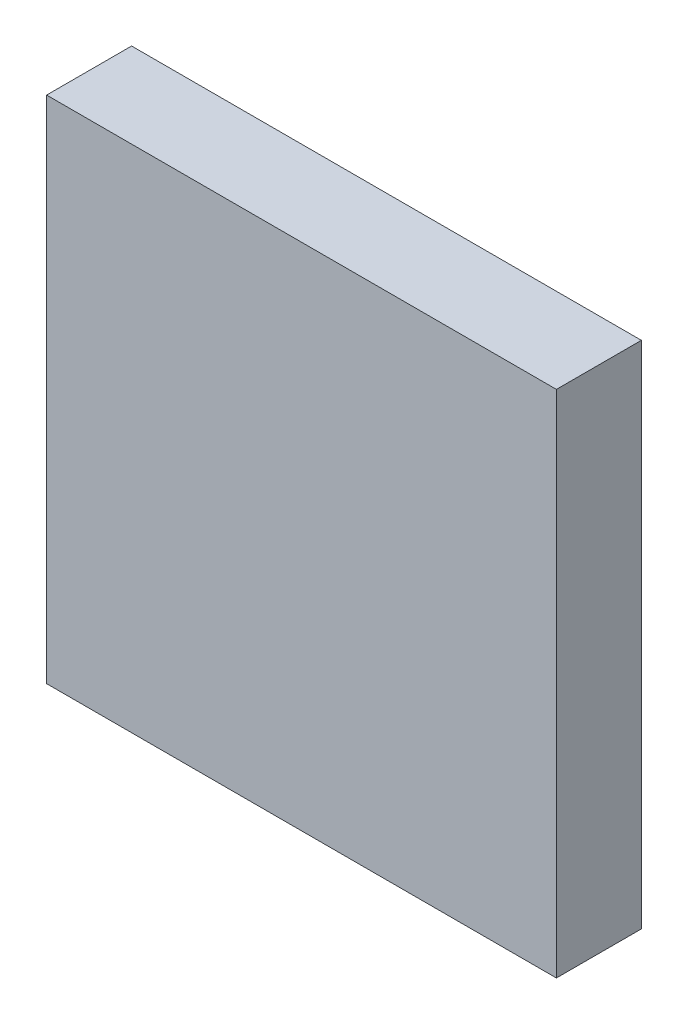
from build123d import *

# Parameters (mm, degrees)
GENERAL_W           = 5.999999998
GENERAL_H           = 5.999999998
BOSS_EXTRUDE1_DEPTH = 0.999999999


with BuildPart() as part:
    # GENERAL → Boss-Extrude1 (new body)
    with BuildSketch(Plane.XY):
        Rectangle(GENERAL_W, GENERAL_H)
    extrude(amount=BOSS_EXTRUDE1_DEPTH)


solid = part.part
